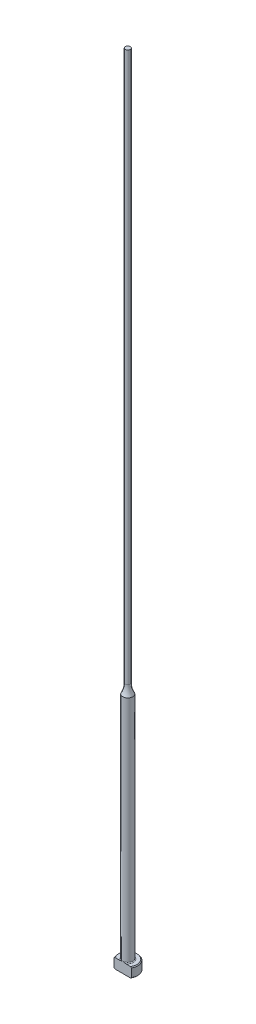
from build123d import *

# Parameters (mm, degrees)
CHAMFER1_SIZE = 0.254
FILLET1_R     = 0.254
KEY_DEPTH     = 255.0396844


with BuildPart() as part:
    # Sketch1 → Revolve1 (revolve)
    with BuildSketch(Plane.XY, mode=Mode.PRIVATE) as revolve1_sk:
        with BuildLine():
            Line((0, 0), (-3.175, 0))
            Line((-3.175, 0), (-3.175, 3.175))
            Line((-3.175, 3.175), (-1.5875, 3.175))
            Line((-1.5875, 3.175), (-1.5875, 76.2))
            ThreePointArc((-1.5875, 76.2), (-0.995388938, 77.686680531), (-0.79375, 79.274180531))
            Line((-0.79375, 79.274180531), (-0.79375, 254))
            Line((-0.79375, 254), (0, 254))
            Line((0, 254), (0, 0))
        make_face()
    revolve(revolve1_sk.sketch.rotate(Axis((0, 259.958771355, 0), (0, -1, 0)), 270), axis=Axis((0, 259.958771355, 0), (0, -1, 0)))

    # Chamfer1
    chamfer1_edges = [part.edges().sort_by_distance(p)[0] for p in [
        (0, 0, -3.175),
        (0, 3.175, -3.175),
    ]]
    chamfer(chamfer1_edges, length=CHAMFER1_SIZE)

    # Fillet1
    fillet1_edges = [part.edges().sort_by_distance(p)[0] for p in [
        (0, 3.175, -1.5875),
    ]]
    fillet(fillet1_edges, radius=FILLET1_R)

    # Sketch2 → KEY (cut, through all)
    with BuildSketch(Plane.XZ):
        with BuildLine():
            Line((-2.749630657, 1.5875), (2.749630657, 1.5875))
            ThreePointArc((2.749630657, 1.5875), (0, 3.175), (-2.749630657, 1.5875))
        make_face()
    extrude(amount=-KEY_DEPTH, mode=Mode.SUBTRACT)


solid = part.part
